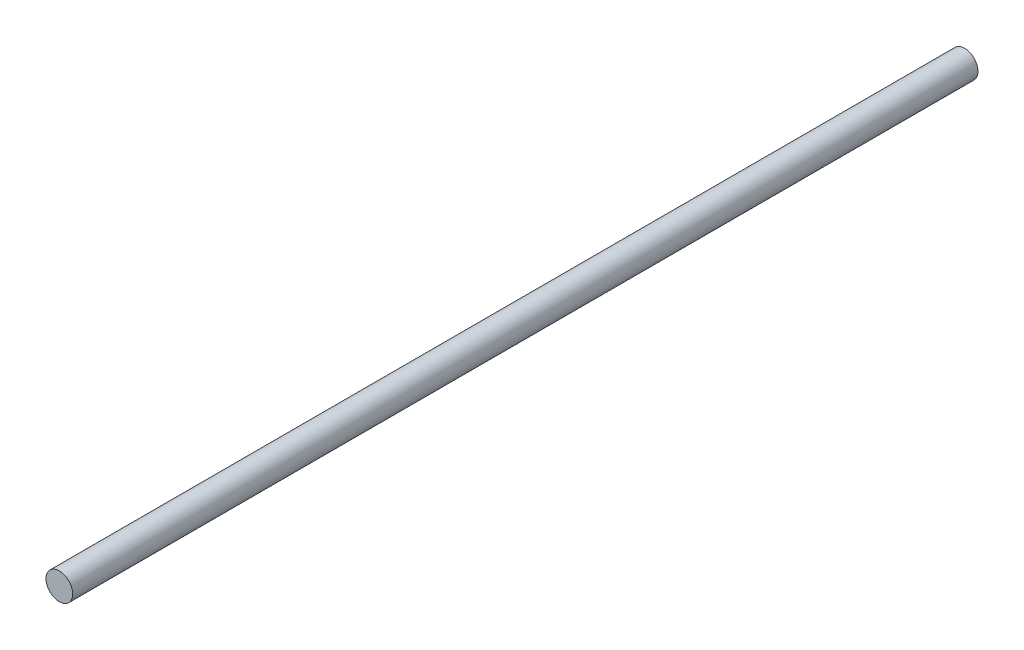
ISO-10303-21;
HEADER;
FILE_DESCRIPTION(('STEP AP214'),'2;1');
FILE_NAME('part.step','',(''),(''),'','','');
FILE_SCHEMA(('AUTOMOTIVE_DESIGN { 1 0 10303 214 1 1 1 1 }'));
ENDSEC;
DATA;
#1=APPLICATION_CONTEXT('core data for automotive mechanical design processes');
#2=APPLICATION_PROTOCOL_DEFINITION('international standard','automotive_design',2000,#1);
#3=PRODUCT_CONTEXT('',#1,'mechanical');
#4=PRODUCT('Part','Part','',(#3));
#5=PRODUCT_RELATED_PRODUCT_CATEGORY('part','',(#4));
#6=PRODUCT_DEFINITION_FORMATION('','',#4);
#7=PRODUCT_DEFINITION_CONTEXT('part definition',#1,'design');
#8=PRODUCT_DEFINITION('design','',#6,#7);
#9=PRODUCT_DEFINITION_SHAPE('','',#8);
#10=(LENGTH_UNIT() NAMED_UNIT(*) SI_UNIT(.MILLI.,.METRE.));
#11=(NAMED_UNIT(*) PLANE_ANGLE_UNIT() SI_UNIT($,.RADIAN.));
#12=(NAMED_UNIT(*) SI_UNIT($,.STERADIAN.) SOLID_ANGLE_UNIT());
#13=UNCERTAINTY_MEASURE_WITH_UNIT(LENGTH_MEASURE(1.E-05),#10,'distance_accuracy_value','');
#14=(GEOMETRIC_REPRESENTATION_CONTEXT(3) GLOBAL_UNCERTAINTY_ASSIGNED_CONTEXT((#13)) GLOBAL_UNIT_ASSIGNED_CONTEXT((#10,
#11,#12)) REPRESENTATION_CONTEXT('',''));
#15=CARTESIAN_POINT('',(0.,0.,0.));
#16=DIRECTION('',(0.,0.,1.));
#17=DIRECTION('',(1.,0.,0.));
#18=AXIS2_PLACEMENT_3D('',#15,#16,#17);
#19=CARTESIAN_POINT('',(0.,0.,215.));
#20=DIRECTION('',(0.,0.,-1.));
#21=DIRECTION('',(-1.,0.,0.));
#22=AXIS2_PLACEMENT_3D('',#19,#20,#21);
#23=CYLINDRICAL_SURFACE('',#22,3.175);
#24=CARTESIAN_POINT('',(0.,0.,215.));
#25=DIRECTION('',(0.,0.,1.));
#26=DIRECTION('',(1.,0.,0.));
#27=AXIS2_PLACEMENT_3D('',#24,#25,#26);
#28=CIRCLE('',#27,3.175);
#29=CARTESIAN_POINT('',(3.175,0.,215.));
#30=VERTEX_POINT('',#29);
#31=EDGE_CURVE('E10',#30,#30,#28,.T.);
#32=ORIENTED_EDGE('',*,*,#31,.F.);
#33=EDGE_LOOP('',(#32));
#34=FACE_BOUND('',#33,.T.);
#35=CARTESIAN_POINT('',(0.,0.,0.));
#36=DIRECTION('',(0.,0.,1.));
#37=DIRECTION('',(1.,0.,0.));
#38=AXIS2_PLACEMENT_3D('',#35,#36,#37);
#39=CIRCLE('',#38,3.175);
#40=CARTESIAN_POINT('',(3.175,0.,0.));
#41=VERTEX_POINT('',#40);
#42=EDGE_CURVE('E32',#41,#41,#39,.T.);
#43=ORIENTED_EDGE('',*,*,#42,.T.);
#44=EDGE_LOOP('',(#43));
#45=FACE_BOUND('',#44,.T.);
#46=ADVANCED_FACE('F29',(#34,#45),#23,.T.);
#47=CARTESIAN_POINT('',(0.,0.,215.));
#48=DIRECTION('',(0.,0.,1.));
#49=DIRECTION('',(1.,0.,0.));
#50=AXIS2_PLACEMENT_3D('',#47,#48,#49);
#51=PLANE('',#50);
#52=ORIENTED_EDGE('',*,*,#31,.T.);
#53=EDGE_LOOP('',(#52));
#54=FACE_BOUND('',#53,.T.);
#55=ADVANCED_FACE('F44',(#54),#51,.T.);
#56=CARTESIAN_POINT('',(0.,0.,0.));
#57=DIRECTION('',(0.,0.,1.));
#58=DIRECTION('',(1.,0.,0.));
#59=AXIS2_PLACEMENT_3D('',#56,#57,#58);
#60=PLANE('',#59);
#61=ORIENTED_EDGE('',*,*,#42,.F.);
#62=EDGE_LOOP('',(#61));
#63=FACE_BOUND('',#62,.T.);
#64=ADVANCED_FACE('F42',(#63),#60,.F.);
#65=CLOSED_SHELL('',(#46,#55,#64));
#66=MANIFOLD_SOLID_BREP('B2',#65);
#67=ADVANCED_BREP_SHAPE_REPRESENTATION('',(#18,#66),#14);
#68=SHAPE_DEFINITION_REPRESENTATION(#9,#67);
ENDSEC;
END-ISO-10303-21;
